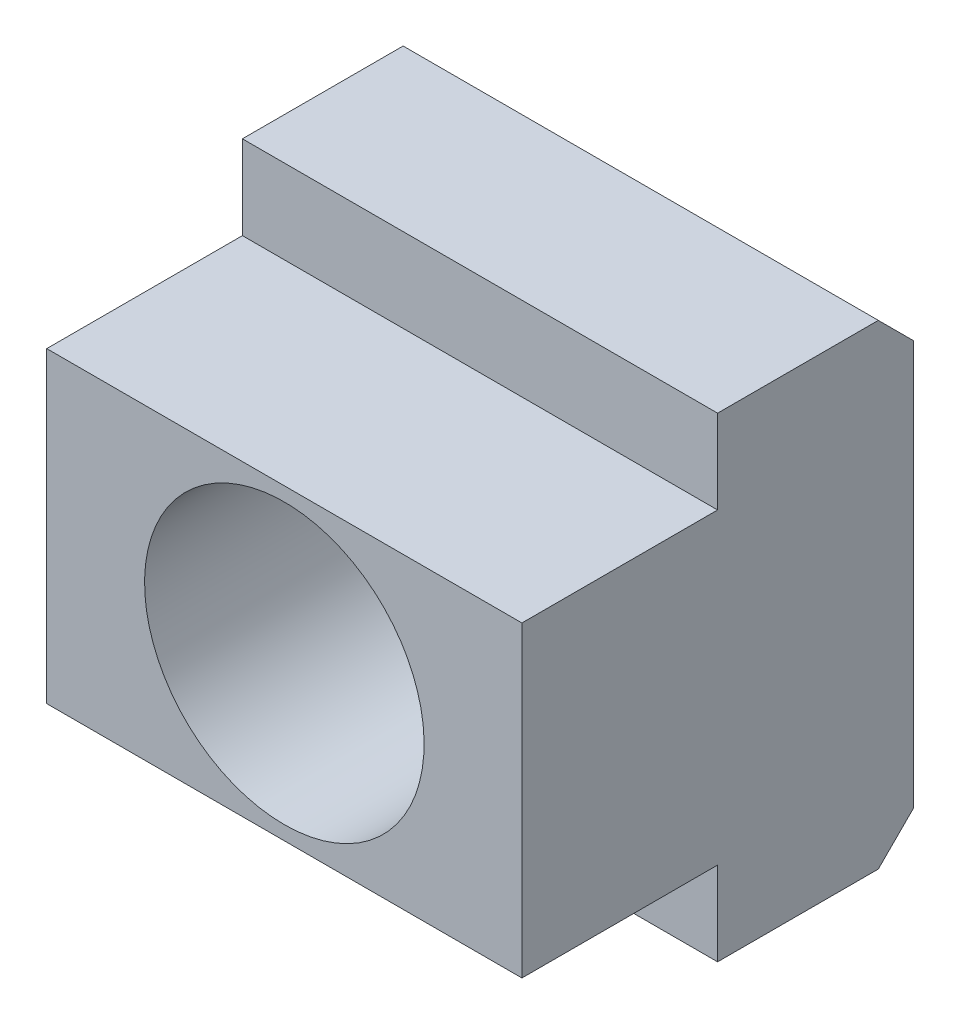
ISO-10303-21;
HEADER;
FILE_DESCRIPTION(('STEP AP214'),'2;1');
FILE_NAME('part.step','',(''),(''),'','','');
FILE_SCHEMA(('AUTOMOTIVE_DESIGN { 1 0 10303 214 1 1 1 1 }'));
ENDSEC;
DATA;
#1=APPLICATION_CONTEXT('core data for automotive mechanical design processes');
#2=APPLICATION_PROTOCOL_DEFINITION('international standard','automotive_design',2000,#1);
#3=PRODUCT_CONTEXT('',#1,'mechanical');
#4=PRODUCT('Part','Part','',(#3));
#5=PRODUCT_RELATED_PRODUCT_CATEGORY('part','',(#4));
#6=PRODUCT_DEFINITION_FORMATION('','',#4);
#7=PRODUCT_DEFINITION_CONTEXT('part definition',#1,'design');
#8=PRODUCT_DEFINITION('design','',#6,#7);
#9=PRODUCT_DEFINITION_SHAPE('','',#8);
#10=(LENGTH_UNIT() NAMED_UNIT(*) SI_UNIT(.MILLI.,.METRE.));
#11=(NAMED_UNIT(*) PLANE_ANGLE_UNIT() SI_UNIT($,.RADIAN.));
#12=(NAMED_UNIT(*) SI_UNIT($,.STERADIAN.) SOLID_ANGLE_UNIT());
#13=UNCERTAINTY_MEASURE_WITH_UNIT(LENGTH_MEASURE(1.E-05),#10,'distance_accuracy_value','');
#14=(GEOMETRIC_REPRESENTATION_CONTEXT(3) GLOBAL_UNCERTAINTY_ASSIGNED_CONTEXT((#13)) GLOBAL_UNIT_ASSIGNED_CONTEXT((#10,
#11,#12)) REPRESENTATION_CONTEXT('',''));
#15=CARTESIAN_POINT('',(0.,0.,0.));
#16=DIRECTION('',(0.,0.,1.));
#17=DIRECTION('',(1.,0.,0.));
#18=AXIS2_PLACEMENT_3D('',#15,#16,#17);
#19=CARTESIAN_POINT('',(17.,11.,14.));
#20=DIRECTION('',(0.,0.,-1.));
#21=DIRECTION('',(0.,1.,0.));
#22=AXIS2_PLACEMENT_3D('',#19,#20,#21);
#23=PLANE('',#22);
#24=DIRECTION('',(-1.,0.,0.));
#25=VECTOR('',#24,1.);
#26=CARTESIAN_POINT('',(17.,-11.,14.));
#27=LINE('',#26,#25);
#28=CARTESIAN_POINT('',(17.,-11.,14.));
#29=VERTEX_POINT('',#28);
#30=CARTESIAN_POINT('',(-17.,-11.,14.));
#31=VERTEX_POINT('',#30);
#32=EDGE_CURVE('E151',#29,#31,#27,.T.);
#33=ORIENTED_EDGE('',*,*,#32,.F.);
#34=DIRECTION('',(0.,-1.,0.));
#35=VECTOR('',#34,1.);
#36=CARTESIAN_POINT('',(17.,11.,14.));
#37=LINE('',#36,#35);
#38=CARTESIAN_POINT('',(17.,11.,14.));
#39=VERTEX_POINT('',#38);
#40=EDGE_CURVE('E130',#39,#29,#37,.T.);
#41=ORIENTED_EDGE('',*,*,#40,.F.);
#42=DIRECTION('',(-1.,0.,0.));
#43=VECTOR('',#42,1.);
#44=CARTESIAN_POINT('',(17.,11.,14.));
#45=LINE('',#44,#43);
#46=CARTESIAN_POINT('',(-17.,11.,14.));
#47=VERTEX_POINT('',#46);
#48=EDGE_CURVE('E153',#39,#47,#45,.T.);
#49=ORIENTED_EDGE('',*,*,#48,.T.);
#50=DIRECTION('',(0.,-1.,0.));
#51=VECTOR('',#50,1.);
#52=CARTESIAN_POINT('',(-17.,11.,14.));
#53=LINE('',#52,#51);
#54=EDGE_CURVE('E181',#47,#31,#53,.T.);
#55=ORIENTED_EDGE('',*,*,#54,.T.);
#56=EDGE_LOOP('',(#33,#41,#49,#55));
#57=FACE_BOUND('',#56,.T.);
#58=CARTESIAN_POINT('',(0.,0.,14.));
#59=DIRECTION('',(0.,0.,1.));
#60=DIRECTION('',(0.,-1.,0.));
#61=AXIS2_PLACEMENT_3D('',#58,#59,#60);
#62=CIRCLE('',#61,10.);
#63=CARTESIAN_POINT('',(0.,-10.,14.));
#64=VERTEX_POINT('',#63);
#65=EDGE_CURVE('E105',#64,#64,#62,.T.);
#66=ORIENTED_EDGE('',*,*,#65,.F.);
#67=EDGE_LOOP('',(#66));
#68=FACE_BOUND('',#67,.T.);
#69=ADVANCED_FACE('F14',(#57,#68),#23,.F.);
#70=CARTESIAN_POINT('',(17.,14.5,-14.));
#71=DIRECTION('',(0.,-0.707106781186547,0.707106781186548));
#72=DIRECTION('',(0.,-0.707106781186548,-0.707106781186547));
#73=AXIS2_PLACEMENT_3D('',#70,#71,#72);
#74=PLANE('',#73);
#75=DIRECTION('',(-1.,0.,0.));
#76=VECTOR('',#75,1.);
#77=CARTESIAN_POINT('',(17.,17.,-11.5));
#78=LINE('',#77,#76);
#79=CARTESIAN_POINT('',(17.,17.,-11.5));
#80=VERTEX_POINT('',#79);
#81=CARTESIAN_POINT('',(-17.,17.,-11.5));
#82=VERTEX_POINT('',#81);
#83=EDGE_CURVE('E9',#80,#82,#78,.T.);
#84=ORIENTED_EDGE('',*,*,#83,.F.);
#85=DIRECTION('',(0.,0.707106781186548,0.707106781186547));
#86=VECTOR('',#85,1.);
#87=CARTESIAN_POINT('',(17.,14.5,-14.));
#88=LINE('',#87,#86);
#89=CARTESIAN_POINT('',(17.,14.5,-14.));
#90=VERTEX_POINT('',#89);
#91=EDGE_CURVE('E140',#90,#80,#88,.T.);
#92=ORIENTED_EDGE('',*,*,#91,.F.);
#93=DIRECTION('',(-1.,0.,0.));
#94=VECTOR('',#93,1.);
#95=CARTESIAN_POINT('',(17.,14.5,-14.));
#96=LINE('',#95,#94);
#97=CARTESIAN_POINT('',(-17.,14.5,-14.));
#98=VERTEX_POINT('',#97);
#99=EDGE_CURVE('E29',#90,#98,#96,.T.);
#100=ORIENTED_EDGE('',*,*,#99,.T.);
#101=DIRECTION('',(0.,0.707106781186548,0.707106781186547));
#102=VECTOR('',#101,1.);
#103=CARTESIAN_POINT('',(-17.,14.5,-14.));
#104=LINE('',#103,#102);
#105=EDGE_CURVE('E101',#98,#82,#104,.T.);
#106=ORIENTED_EDGE('',*,*,#105,.T.);
#107=EDGE_LOOP('',(#84,#92,#100,#106));
#108=FACE_BOUND('',#107,.T.);
#109=ADVANCED_FACE('F102',(#108),#74,.F.);
#110=CARTESIAN_POINT('',(17.,17.,-11.5));
#111=DIRECTION('',(0.,-1.,0.));
#112=DIRECTION('',(0.,0.,-1.));
#113=AXIS2_PLACEMENT_3D('',#110,#111,#112);
#114=PLANE('',#113);
#115=DIRECTION('',(-1.,0.,0.));
#116=VECTOR('',#115,1.);
#117=CARTESIAN_POINT('',(17.,17.,0.));
#118=LINE('',#117,#116);
#119=CARTESIAN_POINT('',(17.,17.,0.));
#120=VERTEX_POINT('',#119);
#121=CARTESIAN_POINT('',(-17.,17.,0.));
#122=VERTEX_POINT('',#121);
#123=EDGE_CURVE('E22',#120,#122,#118,.T.);
#124=ORIENTED_EDGE('',*,*,#123,.F.);
#125=DIRECTION('',(0.,0.,1.));
#126=VECTOR('',#125,1.);
#127=CARTESIAN_POINT('',(17.,17.,-11.5));
#128=LINE('',#127,#126);
#129=EDGE_CURVE('E97',#80,#120,#128,.T.);
#130=ORIENTED_EDGE('',*,*,#129,.F.);
#131=ORIENTED_EDGE('',*,*,#83,.T.);
#132=DIRECTION('',(0.,0.,1.));
#133=VECTOR('',#132,1.);
#134=CARTESIAN_POINT('',(-17.,17.,-11.5));
#135=LINE('',#134,#133);
#136=EDGE_CURVE('E94',#82,#122,#135,.T.);
#137=ORIENTED_EDGE('',*,*,#136,.T.);
#138=EDGE_LOOP('',(#124,#130,#131,#137));
#139=FACE_BOUND('',#138,.T.);
#140=ADVANCED_FACE('F16',(#139),#114,.F.);
#141=CARTESIAN_POINT('',(17.,17.,0.));
#142=DIRECTION('',(0.,0.,-1.));
#143=DIRECTION('',(0.,1.,0.));
#144=AXIS2_PLACEMENT_3D('',#141,#142,#143);
#145=PLANE('',#144);
#146=DIRECTION('',(-1.,0.,0.));
#147=VECTOR('',#146,1.);
#148=CARTESIAN_POINT('',(17.,11.,0.));
#149=LINE('',#148,#147);
#150=CARTESIAN_POINT('',(17.,11.,0.));
#151=VERTEX_POINT('',#150);
#152=CARTESIAN_POINT('',(-17.,11.,0.));
#153=VERTEX_POINT('',#152);
#154=EDGE_CURVE('E155',#151,#153,#149,.T.);
#155=ORIENTED_EDGE('',*,*,#154,.F.);
#156=DIRECTION('',(0.,-1.,0.));
#157=VECTOR('',#156,1.);
#158=CARTESIAN_POINT('',(17.,17.,0.));
#159=LINE('',#158,#157);
#160=EDGE_CURVE('E136',#120,#151,#159,.T.);
#161=ORIENTED_EDGE('',*,*,#160,.F.);
#162=ORIENTED_EDGE('',*,*,#123,.T.);
#163=DIRECTION('',(0.,-1.,0.));
#164=VECTOR('',#163,1.);
#165=CARTESIAN_POINT('',(-17.,17.,0.));
#166=LINE('',#165,#164);
#167=EDGE_CURVE('E110',#122,#153,#166,.T.);
#168=ORIENTED_EDGE('',*,*,#167,.T.);
#169=EDGE_LOOP('',(#155,#161,#162,#168));
#170=FACE_BOUND('',#169,.T.);
#171=ADVANCED_FACE('F158',(#170),#145,.F.);
#172=CARTESIAN_POINT('',(17.,11.,0.));
#173=DIRECTION('',(0.,-1.,0.));
#174=DIRECTION('',(0.,0.,-1.));
#175=AXIS2_PLACEMENT_3D('',#172,#173,#174);
#176=PLANE('',#175);
#177=ORIENTED_EDGE('',*,*,#48,.F.);
#178=DIRECTION('',(0.,0.,1.));
#179=VECTOR('',#178,1.);
#180=CARTESIAN_POINT('',(17.,11.,0.));
#181=LINE('',#180,#179);
#182=EDGE_CURVE('E133',#151,#39,#181,.T.);
#183=ORIENTED_EDGE('',*,*,#182,.F.);
#184=ORIENTED_EDGE('',*,*,#154,.T.);
#185=DIRECTION('',(0.,0.,1.));
#186=VECTOR('',#185,1.);
#187=CARTESIAN_POINT('',(-17.,11.,0.));
#188=LINE('',#187,#186);
#189=EDGE_CURVE('E112',#153,#47,#188,.T.);
#190=ORIENTED_EDGE('',*,*,#189,.T.);
#191=EDGE_LOOP('',(#177,#183,#184,#190));
#192=FACE_BOUND('',#191,.T.);
#193=ADVANCED_FACE('F186',(#192),#176,.F.);
#194=CARTESIAN_POINT('',(17.,-11.,14.));
#195=DIRECTION('',(0.,1.,0.));
#196=DIRECTION('',(0.,0.,1.));
#197=AXIS2_PLACEMENT_3D('',#194,#195,#196);
#198=PLANE('',#197);
#199=DIRECTION('',(-1.,0.,0.));
#200=VECTOR('',#199,1.);
#201=CARTESIAN_POINT('',(17.,-11.,0.));
#202=LINE('',#201,#200);
#203=CARTESIAN_POINT('',(17.,-11.,0.));
#204=VERTEX_POINT('',#203);
#205=CARTESIAN_POINT('',(-17.,-11.,0.));
#206=VERTEX_POINT('',#205);
#207=EDGE_CURVE('E149',#204,#206,#202,.T.);
#208=ORIENTED_EDGE('',*,*,#207,.F.);
#209=DIRECTION('',(0.,0.,-1.));
#210=VECTOR('',#209,1.);
#211=CARTESIAN_POINT('',(17.,-11.,14.));
#212=LINE('',#211,#210);
#213=EDGE_CURVE('E127',#29,#204,#212,.T.);
#214=ORIENTED_EDGE('',*,*,#213,.F.);
#215=ORIENTED_EDGE('',*,*,#32,.T.);
#216=DIRECTION('',(0.,0.,-1.));
#217=VECTOR('',#216,1.);
#218=CARTESIAN_POINT('',(-17.,-11.,14.));
#219=LINE('',#218,#217);
#220=EDGE_CURVE('E178',#31,#206,#219,.T.);
#221=ORIENTED_EDGE('',*,*,#220,.T.);
#222=EDGE_LOOP('',(#208,#214,#215,#221));
#223=FACE_BOUND('',#222,.T.);
#224=ADVANCED_FACE('F195',(#223),#198,.F.);
#225=CARTESIAN_POINT('',(17.,-11.,0.));
#226=DIRECTION('',(0.,0.,-1.));
#227=DIRECTION('',(0.,1.,0.));
#228=AXIS2_PLACEMENT_3D('',#225,#226,#227);
#229=PLANE('',#228);
#230=DIRECTION('',(-1.,0.,0.));
#231=VECTOR('',#230,1.);
#232=CARTESIAN_POINT('',(17.,-17.,0.));
#233=LINE('',#232,#231);
#234=CARTESIAN_POINT('',(17.,-17.,0.));
#235=VERTEX_POINT('',#234);
#236=CARTESIAN_POINT('',(-17.,-17.,0.));
#237=VERTEX_POINT('',#236);
#238=EDGE_CURVE('E147',#235,#237,#233,.T.);
#239=ORIENTED_EDGE('',*,*,#238,.F.);
#240=DIRECTION('',(0.,-1.,0.));
#241=VECTOR('',#240,1.);
#242=CARTESIAN_POINT('',(17.,-11.,0.));
#243=LINE('',#242,#241);
#244=EDGE_CURVE('E124',#204,#235,#243,.T.);
#245=ORIENTED_EDGE('',*,*,#244,.F.);
#246=ORIENTED_EDGE('',*,*,#207,.T.);
#247=DIRECTION('',(0.,-1.,0.));
#248=VECTOR('',#247,1.);
#249=CARTESIAN_POINT('',(-17.,-11.,0.));
#250=LINE('',#249,#248);
#251=EDGE_CURVE('E175',#206,#237,#250,.T.);
#252=ORIENTED_EDGE('',*,*,#251,.T.);
#253=EDGE_LOOP('',(#239,#245,#246,#252));
#254=FACE_BOUND('',#253,.T.);
#255=ADVANCED_FACE('F197',(#254),#229,.F.);
#256=CARTESIAN_POINT('',(17.,-17.,0.));
#257=DIRECTION('',(0.,1.,0.));
#258=DIRECTION('',(0.,0.,1.));
#259=AXIS2_PLACEMENT_3D('',#256,#257,#258);
#260=PLANE('',#259);
#261=DIRECTION('',(-1.,0.,0.));
#262=VECTOR('',#261,1.);
#263=CARTESIAN_POINT('',(17.,-17.,-11.5));
#264=LINE('',#263,#262);
#265=CARTESIAN_POINT('',(17.,-17.,-11.5));
#266=VERTEX_POINT('',#265);
#267=CARTESIAN_POINT('',(-17.,-17.,-11.5));
#268=VERTEX_POINT('',#267);
#269=EDGE_CURVE('E145',#266,#268,#264,.T.);
#270=ORIENTED_EDGE('',*,*,#269,.F.);
#271=DIRECTION('',(0.,0.,-1.));
#272=VECTOR('',#271,1.);
#273=CARTESIAN_POINT('',(17.,-17.,0.));
#274=LINE('',#273,#272);
#275=EDGE_CURVE('E121',#235,#266,#274,.T.);
#276=ORIENTED_EDGE('',*,*,#275,.F.);
#277=ORIENTED_EDGE('',*,*,#238,.T.);
#278=DIRECTION('',(0.,0.,-1.));
#279=VECTOR('',#278,1.);
#280=CARTESIAN_POINT('',(-17.,-17.,0.));
#281=LINE('',#280,#279);
#282=EDGE_CURVE('E168',#237,#268,#281,.T.);
#283=ORIENTED_EDGE('',*,*,#282,.T.);
#284=EDGE_LOOP('',(#270,#276,#277,#283));
#285=FACE_BOUND('',#284,.T.);
#286=ADVANCED_FACE('F200',(#285),#260,.F.);
#287=CARTESIAN_POINT('',(17.,-17.,-11.5));
#288=DIRECTION('',(0.,0.707106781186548,0.707106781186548));
#289=DIRECTION('',(0.,-0.707106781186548,0.707106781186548));
#290=AXIS2_PLACEMENT_3D('',#287,#288,#289);
#291=PLANE('',#290);
#292=DIRECTION('',(-1.,0.,0.));
#293=VECTOR('',#292,1.);
#294=CARTESIAN_POINT('',(17.,-14.5,-14.));
#295=LINE('',#294,#293);
#296=CARTESIAN_POINT('',(17.,-14.5,-14.));
#297=VERTEX_POINT('',#296);
#298=CARTESIAN_POINT('',(-17.,-14.5,-14.));
#299=VERTEX_POINT('',#298);
#300=EDGE_CURVE('E37',#297,#299,#295,.T.);
#301=ORIENTED_EDGE('',*,*,#300,.F.);
#302=DIRECTION('',(0.,0.707106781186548,-0.707106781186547));
#303=VECTOR('',#302,1.);
#304=CARTESIAN_POINT('',(17.,-17.,-11.5));
#305=LINE('',#304,#303);
#306=EDGE_CURVE('E119',#266,#297,#305,.T.);
#307=ORIENTED_EDGE('',*,*,#306,.F.);
#308=ORIENTED_EDGE('',*,*,#269,.T.);
#309=DIRECTION('',(0.,0.707106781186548,-0.707106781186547));
#310=VECTOR('',#309,1.);
#311=CARTESIAN_POINT('',(-17.,-17.,-11.5));
#312=LINE('',#311,#310);
#313=EDGE_CURVE('E164',#268,#299,#312,.T.);
#314=ORIENTED_EDGE('',*,*,#313,.T.);
#315=EDGE_LOOP('',(#301,#307,#308,#314));
#316=FACE_BOUND('',#315,.T.);
#317=ADVANCED_FACE('F165',(#316),#291,.F.);
#318=CARTESIAN_POINT('',(17.,-14.5,-14.));
#319=DIRECTION('',(0.,0.,1.));
#320=DIRECTION('',(1.,0.,0.));
#321=AXIS2_PLACEMENT_3D('',#318,#319,#320);
#322=PLANE('',#321);
#323=CARTESIAN_POINT('',(0.,0.,-14.));
#324=DIRECTION('',(0.,0.,1.));
#325=DIRECTION('',(0.,-1.,0.));
#326=AXIS2_PLACEMENT_3D('',#323,#324,#325);
#327=CIRCLE('',#326,10.);
#328=CARTESIAN_POINT('',(0.,-10.,-14.));
#329=VERTEX_POINT('',#328);
#330=EDGE_CURVE('E319',#329,#329,#327,.T.);
#331=ORIENTED_EDGE('',*,*,#330,.T.);
#332=EDGE_LOOP('',(#331));
#333=FACE_BOUND('',#332,.T.);
#334=DIRECTION('',(0.,1.,0.));
#335=VECTOR('',#334,1.);
#336=CARTESIAN_POINT('',(17.,-14.5,-14.));
#337=LINE('',#336,#335);
#338=EDGE_CURVE('E116',#297,#90,#337,.T.);
#339=ORIENTED_EDGE('',*,*,#338,.F.);
#340=ORIENTED_EDGE('',*,*,#300,.T.);
#341=DIRECTION('',(0.,1.,0.));
#342=VECTOR('',#341,1.);
#343=CARTESIAN_POINT('',(-17.,-14.5,-14.));
#344=LINE('',#343,#342);
#345=EDGE_CURVE('E142',#299,#98,#344,.T.);
#346=ORIENTED_EDGE('',*,*,#345,.T.);
#347=ORIENTED_EDGE('',*,*,#99,.F.);
#348=EDGE_LOOP('',(#339,#340,#346,#347));
#349=FACE_BOUND('',#348,.T.);
#350=ADVANCED_FACE('F162',(#333,#349),#322,.F.);
#351=CARTESIAN_POINT('',(17.,0.,-28.5));
#352=DIRECTION('',(-1.,0.,0.));
#353=DIRECTION('',(0.,0.,1.));
#354=AXIS2_PLACEMENT_3D('',#351,#352,#353);
#355=PLANE('',#354);
#356=ORIENTED_EDGE('',*,*,#91,.T.);
#357=ORIENTED_EDGE('',*,*,#129,.T.);
#358=ORIENTED_EDGE('',*,*,#160,.T.);
#359=ORIENTED_EDGE('',*,*,#182,.T.);
#360=ORIENTED_EDGE('',*,*,#40,.T.);
#361=ORIENTED_EDGE('',*,*,#213,.T.);
#362=ORIENTED_EDGE('',*,*,#244,.T.);
#363=ORIENTED_EDGE('',*,*,#275,.T.);
#364=ORIENTED_EDGE('',*,*,#306,.T.);
#365=ORIENTED_EDGE('',*,*,#338,.T.);
#366=EDGE_LOOP('',(#356,#357,#358,#359,#360,#361,#362,#363,#364,#365));
#367=FACE_BOUND('',#366,.T.);
#368=ADVANCED_FACE('F160',(#367),#355,.F.);
#369=CARTESIAN_POINT('',(-17.,0.,-28.5));
#370=DIRECTION('',(-1.,0.,0.));
#371=DIRECTION('',(0.,0.,1.));
#372=AXIS2_PLACEMENT_3D('',#369,#370,#371);
#373=PLANE('',#372);
#374=ORIENTED_EDGE('',*,*,#105,.F.);
#375=ORIENTED_EDGE('',*,*,#345,.F.);
#376=ORIENTED_EDGE('',*,*,#313,.F.);
#377=ORIENTED_EDGE('',*,*,#282,.F.);
#378=ORIENTED_EDGE('',*,*,#251,.F.);
#379=ORIENTED_EDGE('',*,*,#220,.F.);
#380=ORIENTED_EDGE('',*,*,#54,.F.);
#381=ORIENTED_EDGE('',*,*,#189,.F.);
#382=ORIENTED_EDGE('',*,*,#167,.F.);
#383=ORIENTED_EDGE('',*,*,#136,.F.);
#384=EDGE_LOOP('',(#374,#375,#376,#377,#378,#379,#380,#381,#382,#383));
#385=FACE_BOUND('',#384,.T.);
#386=ADVANCED_FACE('F107',(#385),#373,.T.);
#387=CARTESIAN_POINT('',(0.,0.,14.));
#388=DIRECTION('',(0.,0.,1.));
#389=DIRECTION('',(0.,-1.,0.));
#390=AXIS2_PLACEMENT_3D('',#387,#388,#389);
#391=CYLINDRICAL_SURFACE('',#390,10.);
#392=ORIENTED_EDGE('',*,*,#65,.T.);
#393=EDGE_LOOP('',(#392));
#394=FACE_BOUND('',#393,.T.);
#395=ORIENTED_EDGE('',*,*,#330,.F.);
#396=EDGE_LOOP('',(#395));
#397=FACE_BOUND('',#396,.T.);
#398=ADVANCED_FACE('F285',(#394,#397),#391,.F.);
#399=CLOSED_SHELL('',(#69,#109,#140,#171,#193,#224,#255,#286,#317,#350,#368,#386,#398));
#400=MANIFOLD_SOLID_BREP('B1',#399);
#401=ADVANCED_BREP_SHAPE_REPRESENTATION('',(#18,#400),#14);
#402=SHAPE_DEFINITION_REPRESENTATION(#9,#401);
ENDSEC;
END-ISO-10303-21;
